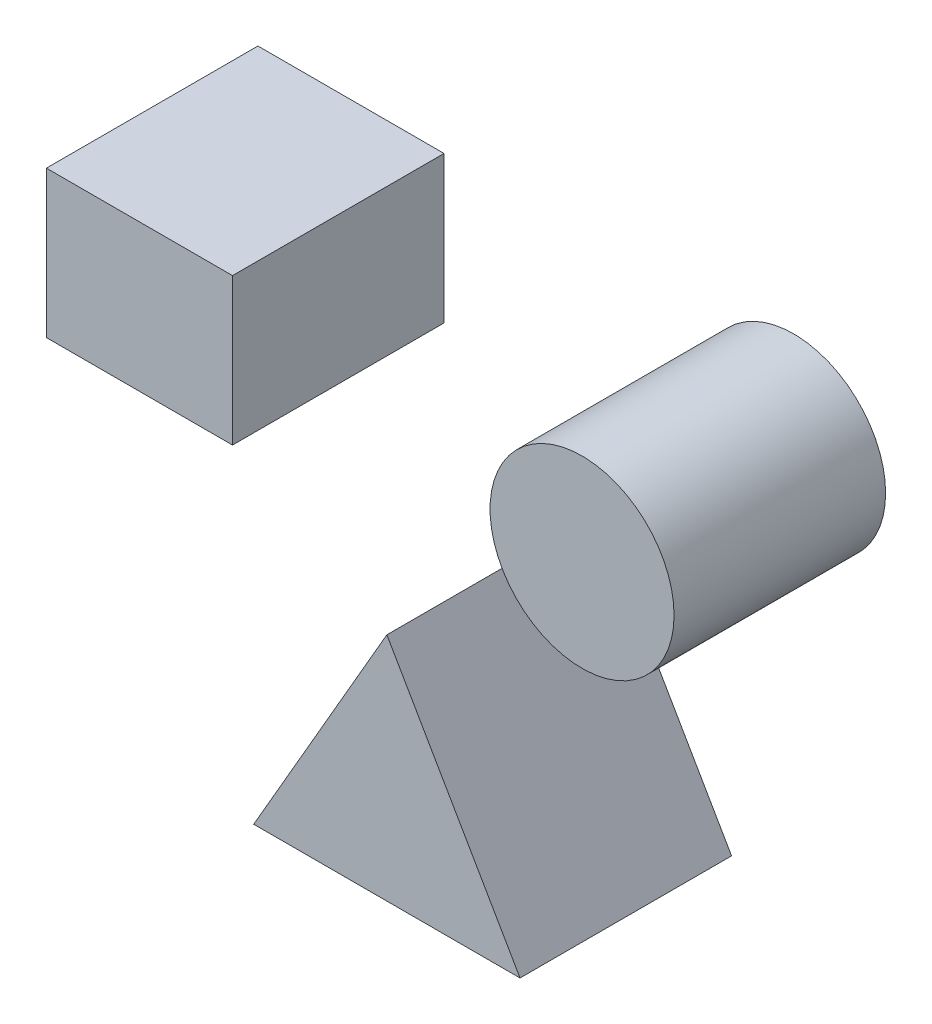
from build123d import *

# Parameters (mm, degrees)
SKETCH1_R        = 14.912400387
EXTRUDE1_DEPTH   = 34.29
EXTRUDE1_2_DEPTH = 34.29
SKETCH1_W        = 30.16976993
SKETCH1_H        = 23.792420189
EXTRUDE1_3_DEPTH = 34.29


with BuildPart() as part:
    # Sketch1 → Extrude1 (new body)
    with BuildSketch(Plane.XY):
        with Locations((38.999946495, 24.037702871)):
            Circle(SKETCH1_R)
    extrude(amount=EXTRUDE1_DEPTH)


with BuildPart() as body_2:
    # Sketch1 → Extrude1 2 (new body)
    with BuildSketch(Plane.XY):
        Polygon((-14.226395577, -39.367870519), (7.358480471, -1.981768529), (28.943356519, -39.367870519), align=None)
    extrude(amount=EXTRUDE1_2_DEPTH)


with BuildPart() as body_3:
    # Sketch1 → Extrude1 3 (new body)
    with BuildSketch(Plane.XY):
        with Locations((-32.745238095, 24.037702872)):
            Rectangle(SKETCH1_W, SKETCH1_H)
    extrude(amount=EXTRUDE1_3_DEPTH)


solid = Compound([part.part, body_2.part, body_3.part])
